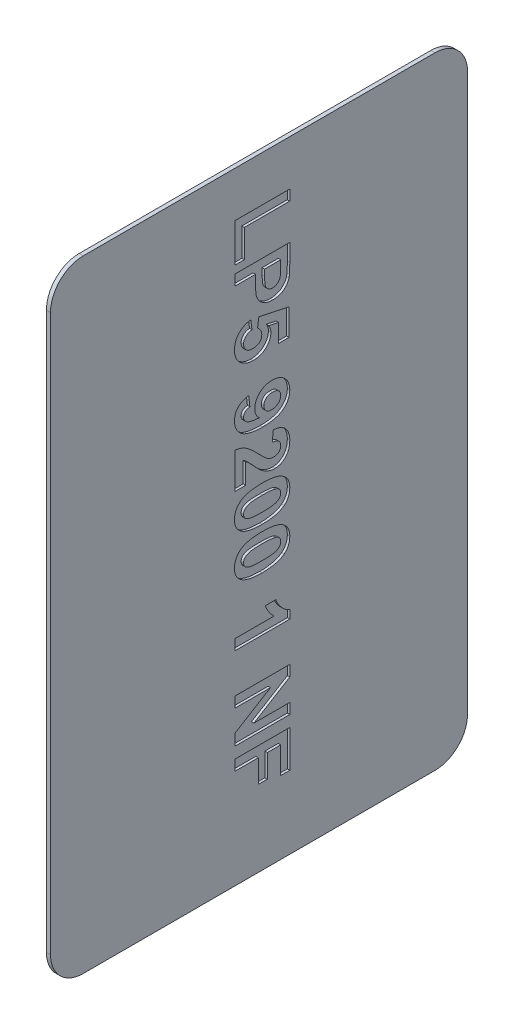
from build123d import *

# Parameters (mm, degrees)
BOSS_EXTRU_1_DEPTH      = 0.5
ENL_V_MAT_EXTRU_3_DEPTH = 0.3


with BuildPart() as part:
    # Esquisse1 → Boss.-Extru.1 (new body)
    with BuildSketch(Plane(origin=(0.5, 0, 0), x_dir=(0, 0, -1), z_dir=(1, 0, 0))):
        with BuildLine():
            Line((25.5, -34), (25.5, 34))
            ThreePointArc((25.5, 34), (24.328427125, 36.828427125), (21.5, 38))
            Line((21.5, 38), (-21.5, 38))
            ThreePointArc((-21.5, 38), (-24.328427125, 36.828427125), (-25.5, 34))
            Line((-25.5, 34), (-25.5, -34))
            ThreePointArc((-25.5, -34), (-24.328427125, -36.828427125), (-21.5, -38))
            Line((-21.5, -38), (21.5, -38))
            ThreePointArc((21.5, -38), (24.328427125, -36.828427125), (25.5, -34))
        make_face()
    extrude(amount=-BOSS_EXTRU_1_DEPTH)

    # Esquisse4 → Enl_v. mat.-Extru.3 (cut)
    # profile 1 of 10: a face of its own
    with BuildSketch(Plane(origin=(0.5, 0, 0), x_dir=(0, 0, -1), z_dir=(1, 0, 0))):
        Polygon((-2.919570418, 32.447935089), (3.758058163, 32.447935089), (3.758058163, 31.163775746), (-1.806632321, 31.163775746), (-1.806632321, 27.739350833), (-2.919570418, 27.739350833), align=None)
    # profile 2 of 10: a face of its own
    with BuildSketch(Plane(origin=(0.5, 0, 0), x_dir=(0, 0, -1), z_dir=(1, 0, 0))):
        with BuildLine():
            Line((-2.919570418, 26.797633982), (3.758058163, 26.797633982))
            Line((3.758058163, 26.797633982), (3.758058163, 24.661381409))
            add(Edge.make_bspline(
                [(3.758058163, 24.661381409), (3.757959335, 24.564620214), (3.757770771, 24.379998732), (3.752080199, 24.116014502), (3.74423189, 23.878329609), (3.734249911, 23.666868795), (3.719649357, 23.482189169), (3.702162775, 23.323880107), (3.684158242, 23.19121424), (3.664975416, 23.112701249), (3.656395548, 23.077584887)],
                knots=[0, 0, 0, 0, 1.460492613, 2.786636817, 3.985312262, 5.05006335, 5.98179196, 6.7807735, 7.454678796, 8, 8, 8, 8], degree=3))
            add(Edge.make_bspline(
                [(3.656395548, 23.077584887), (3.643079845, 23.030885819), (3.616651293, 22.938199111), (3.560309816, 22.805407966), (3.495013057, 22.677418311), (3.4171911, 22.555838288), (3.328225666, 22.440254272), (3.228841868, 22.330323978), (3.118592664, 22.225456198), (2.997689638, 22.12712091), (2.866766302, 22.036999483), (2.725538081, 21.95932971), (2.575098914, 21.893485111), (2.415008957, 21.840568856), (2.246316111, 21.796817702), (2.067513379, 21.768887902), (1.879991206, 21.748697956), (1.751617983, 21.747314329), (1.686013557, 21.746607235)],
                knots=[0, 0, 0, 0, 0.907183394, 1.800546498, 2.691728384, 3.591410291, 4.495216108, 5.416087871, 6.359626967, 7.337496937, 8.327236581, 9.327316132, 10.346534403, 11.393207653, 12.477041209, 13.600953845, 14.773980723, 16, 16, 16, 16], degree=3))
            add(Edge.make_bspline(
                [(1.686013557, 21.746607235), (1.586391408, 21.748667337), (1.3946133, 21.752633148), (1.119687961, 21.797035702), (0.868518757, 21.864699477), (0.643717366, 21.963801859), (0.443504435, 22.084086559), (0.265046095, 22.218759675), (0.108783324, 22.36889434), (-0.022888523, 22.533025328), (-0.131219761, 22.706185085), (-0.223460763, 22.879793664), (-0.294404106, 23.056024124), (-0.325311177, 23.176183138), (-0.340550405, 23.235429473)],
                knots=[0, 0, 0, 0, 1.312446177, 2.526530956, 3.662051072, 4.733637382, 5.754065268, 6.735959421, 7.675686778, 8.604015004, 9.502732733, 10.365317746, 11.193993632, 12, 12, 12, 12], degree=3))
            add(Edge.make_bspline(
                [(-0.340550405, 23.235429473), (-0.348594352, 23.277716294), (-0.365550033, 23.366851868), (-0.382451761, 23.508215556), (-0.401160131, 23.662733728), (-0.413362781, 23.831041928), (-0.424790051, 24.012936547), (-0.430185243, 24.208346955), (-0.436685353, 24.416993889), (-0.436802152, 24.560604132), (-0.436862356, 24.634628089)],
                knots=[0, 0, 0, 0, 0.735353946, 1.55003838, 2.431865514, 3.394945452, 4.432993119, 5.54609699, 6.735134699, 8, 8, 8, 8], degree=3))
            Line((-0.436862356, 24.634628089), (-0.436862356, 25.513474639))
            Line((-0.436862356, 25.513474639), (-2.919570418, 25.513474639))
            Line((-2.919570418, 25.513474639), (-2.919570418, 26.797633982))
        make_face()
        with BuildLine():
            Line((2.645120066, 25.513474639), (0.676075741, 25.513474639))
            Line((0.676075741, 25.513474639), (0.676075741, 24.742979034))
            add(Edge.make_bspline(
                [(0.676075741, 24.742979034), (0.676161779, 24.676535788), (0.676326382, 24.549421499), (0.682234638, 24.367040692), (0.68944676, 24.201949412), (0.701384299, 24.053802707), (0.717117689, 23.923494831), (0.735936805, 23.810153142), (0.756131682, 23.713645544), (0.789597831, 23.609285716), (0.843743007, 23.497704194), (0.921563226, 23.378548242), (1.014606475, 23.273869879), (1.12388255, 23.186763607), (1.2452946, 23.11718498), (1.377598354, 23.067366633), (1.518601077, 23.035198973), (1.616277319, 23.03226075), (1.665948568, 23.030766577)],
                knots=[0, 0, 0, 0, 1.411705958, 2.700771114, 3.876961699, 4.922619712, 5.858038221, 6.66485904, 7.363650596, 7.950905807, 8.989198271, 9.987739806, 10.967313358, 11.951275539, 12.944273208, 13.927870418, 14.946261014, 16, 16, 16, 16], degree=3))
            add(Edge.make_bspline(
                [(1.665948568, 23.030766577), (1.726447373, 23.032869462), (1.843746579, 23.036946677), (2.010800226, 23.081906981), (2.162403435, 23.151275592), (2.293839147, 23.250453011), (2.404365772, 23.370256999), (2.496327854, 23.504911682), (2.560683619, 23.657292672), (2.585619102, 23.765137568), (2.598301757, 23.819989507)],
                knots=[0, 0, 0, 0, 1.085904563, 2.105425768, 3.088705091, 4.068969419, 5.045188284, 6.010769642, 6.988240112, 8, 8, 8, 8], degree=3))
            add(Edge.make_bspline(
                [(2.598301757, 23.819989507), (2.602077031, 23.843593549), (2.610456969, 23.895987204), (2.619202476, 23.983076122), (2.627156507, 24.086102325), (2.633687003, 24.205190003), (2.638792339, 24.33986712), (2.643265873, 24.490577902), (2.643625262, 24.656925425), (2.644607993, 24.773300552), (2.645120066, 24.833940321)],
                knots=[0, 0, 0, 0, 0.564603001, 1.253243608, 2.066786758, 3.005752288, 4.070476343, 5.250658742, 6.567396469, 8, 8, 8, 8], degree=3))
            Line((2.645120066, 24.833940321), (2.645120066, 25.513474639))
        make_face(mode=Mode.SUBTRACT)
    # profile 3 of 10: a face of its own
    with BuildSketch(Plane(origin=(0.5, 0, 0), x_dir=(0, 0, -1), z_dir=(1, 0, 0))):
        with BuildLine():
            Line((-1.009383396, 20.976111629), (-0.86491547, 19.863173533))
            add(Edge.make_bspline(
                [(-0.86491547, 19.863173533), (-0.940370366, 19.850826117), (-1.085671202, 19.827049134), (-1.289073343, 19.753846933), (-1.466991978, 19.649489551), (-1.618022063, 19.518112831), (-1.739866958, 19.368247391), (-1.827938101, 19.203517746), (-1.882485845, 19.027429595), (-1.888975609, 18.90533951), (-1.892242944, 18.843872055)],
                knots=[0, 0, 0, 0, 1.155217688, 2.224562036, 3.249849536, 4.259092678, 5.238040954, 6.15568152, 7.071459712, 8, 8, 8, 8], degree=3))
            add(Edge.make_bspline(
                [(-1.892242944, 18.843872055), (-1.891615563, 18.808156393), (-1.890387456, 18.738242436), (-1.876443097, 18.635215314), (-1.853796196, 18.53679158), (-1.823033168, 18.442061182), (-1.78267174, 18.351933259), (-1.732734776, 18.266303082), (-1.674920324, 18.184116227), (-1.608736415, 18.106418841), (-1.531682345, 18.036686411), (-1.446452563, 17.974754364), (-1.351002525, 17.924086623), (-1.24799169, 17.880405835), (-1.134395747, 17.849504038), (-1.012987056, 17.824719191), (-0.882117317, 17.812127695), (-0.792256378, 17.809747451), (-0.745863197, 17.808518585)],
                knots=[0, 0, 0, 0, 0.98109136, 1.920501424, 2.850996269, 3.75396817, 4.653607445, 5.559568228, 6.474190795, 7.412641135, 8.358186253, 9.324081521, 10.300185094, 11.322066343, 12.392681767, 13.529496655, 14.72453472, 16, 16, 16, 16], degree=3))
            add(Edge.make_bspline(
                [(-0.745863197, 17.808518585), (-0.70213153, 17.809212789), (-0.617612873, 17.810554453), (-0.495159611, 17.82300196), (-0.380725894, 17.842108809), (-0.275148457, 17.872504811), (-0.176464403, 17.907219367), (-0.088172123, 17.954023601), (-0.006433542, 18.005378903), (0.064332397, 18.067976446), (0.126883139, 18.136170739), (0.182525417, 18.208838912), (0.229488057, 18.286950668), (0.268323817, 18.369766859), (0.298342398, 18.457645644), (0.317305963, 18.550778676), (0.331900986, 18.648120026), (0.333049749, 18.714951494), (0.33363325, 18.74889777)],
                knots=[0, 0, 0, 0, 1.292262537, 2.497510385, 3.635136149, 4.715991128, 5.741845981, 6.720379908, 7.663568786, 8.58853187, 9.502632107, 10.396263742, 11.289117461, 12.191261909, 13.095714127, 14.026387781, 14.997526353, 16, 16, 16, 16], degree=3))
            add(Edge.make_bspline(
                [(0.33363325, 18.74889777), (0.332094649, 18.791813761), (0.329025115, 18.877431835), (0.3040728, 19.003819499), (0.263450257, 19.126837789), (0.20690085, 19.246358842), (0.133972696, 19.362066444), (0.044423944, 19.47345964), (-0.060204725, 19.582450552), (-0.139259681, 19.649399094), (-0.180030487, 19.683926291)],
                knots=[0, 0, 0, 0, 0.931687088, 1.85873035, 2.786835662, 3.740075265, 4.723687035, 5.750832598, 6.840042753, 8, 8, 8, 8], degree=3))
            Line((-0.180030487, 19.683926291), (-0.022185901, 20.804890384))
            Line((-0.022185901, 20.804890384), (3.67244754, 20.034394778))
            Line((3.67244754, 20.034394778), (3.67244754, 16.781191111))
            Line((3.67244754, 16.781191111), (2.388288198, 16.781191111))
            Line((2.388288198, 16.781191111), (2.388288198, 19.004391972))
            Line((2.388288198, 19.004391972), (1.196427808, 19.266574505))
            add(Edge.make_bspline(
                [(1.196427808, 19.266574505), (1.234976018, 19.199762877), (1.310045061, 19.069653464), (1.387321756, 18.861932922), (1.436919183, 18.653145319), (1.443370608, 18.51240005), (1.446571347, 18.44257226)],
                knots=[0, 0, 0, 0, 1.060051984, 2.064352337, 3.039669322, 4, 4, 4, 4], degree=3))
            add(Edge.make_bspline(
                [(1.446571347, 18.44257226), (1.44480484, 18.376928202), (1.441315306, 18.247255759), (1.41268479, 18.057080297), (1.365498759, 17.874665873), (1.299834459, 17.699396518), (1.213765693, 17.532525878), (1.109738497, 17.37261542), (0.985947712, 17.221973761), (0.845967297, 17.078982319), (0.691095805, 16.948584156), (0.52221629, 16.83597497), (0.343534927, 16.738713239), (0.153077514, 16.65953066), (-0.049420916, 16.599903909), (-0.262216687, 16.555249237), (-0.486653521, 16.530234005), (-0.63968299, 16.526344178), (-0.717772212, 16.524359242)],
                knots=[0, 0, 0, 0, 0.974409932, 1.924837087, 2.848242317, 3.768103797, 4.697919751, 5.630842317, 6.595644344, 7.588240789, 8.59876155, 9.595918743, 10.597287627, 11.615415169, 12.652315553, 13.727511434, 14.840374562, 16, 16, 16, 16], degree=3))
            add(Edge.make_bspline(
                [(-0.717772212, 16.524359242), (-0.783364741, 16.526137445), (-0.913552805, 16.529666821), (-1.1061336, 16.550660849), (-1.293437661, 16.588790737), (-1.474938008, 16.640925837), (-1.652034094, 16.706659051), (-1.822837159, 16.788418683), (-1.988797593, 16.885197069), (-2.093456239, 16.960035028), (-2.14639948, 16.997893)],
                knots=[0, 0, 0, 0, 1.0275977, 2.039576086, 3.029943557, 4.018141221, 4.995043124, 5.985410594, 6.980887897, 8, 8, 8, 8], degree=3))
            add(Edge.make_bspline(
                [(-2.14639948, 16.997893), (-2.214583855, 17.053060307), (-2.348778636, 17.161635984), (-2.525114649, 17.347556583), (-2.673807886, 17.549876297), (-2.794289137, 17.768392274), (-2.890859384, 18.001289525), (-2.956813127, 18.251004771), (-2.997974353, 18.515664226), (-3.002743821, 18.697464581), (-3.005181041, 18.790365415)],
                knots=[0, 0, 0, 0, 1.018155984, 2.003849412, 2.967446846, 3.927472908, 4.896208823, 5.888955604, 6.921246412, 8, 8, 8, 8], degree=3))
            add(Edge.make_bspline(
                [(-3.005181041, 18.790365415), (-3.003821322, 18.865348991), (-3.001166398, 19.011758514), (-2.975087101, 19.226201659), (-2.932243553, 19.42972831), (-2.874175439, 19.623306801), (-2.796612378, 19.805098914), (-2.704597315, 19.977336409), (-2.594153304, 20.138705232), (-2.4667012, 20.28825619), (-2.325805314, 20.425576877), (-2.171646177, 20.548063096), (-2.006794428, 20.657043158), (-1.829586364, 20.75043873), (-1.641264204, 20.830033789), (-1.440862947, 20.893410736), (-1.229719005, 20.945592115), (-1.083641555, 20.965825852), (-1.009383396, 20.976111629)],
                knots=[0, 0, 0, 0, 1.098896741, 2.145655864, 3.16104256, 4.145315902, 5.10323158, 6.053780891, 7.003858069, 7.963890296, 8.930045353, 9.883557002, 10.846278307, 11.82296847, 12.816080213, 13.83936887, 14.901647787, 16, 16, 16, 16], degree=3))
        make_face()
    # profile 4 of 10: a face of its own
    with BuildSketch(Plane(origin=(0.5, 0, 0), x_dir=(0, 0, -1), z_dir=(1, 0, 0))):
        with BuildLine():
            Line((-1.263539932, 13.099934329), (-1.121747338, 11.815774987))
            add(Edge.make_bspline(
                [(-1.121747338, 11.815774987), (-1.18320919, 11.807323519), (-1.29938471, 11.791348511), (-1.459293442, 11.741002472), (-1.59553112, 11.675429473), (-1.705492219, 11.589161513), (-1.790434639, 11.486954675), (-1.850637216, 11.36871239), (-1.885672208, 11.23497789), (-1.889998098, 11.140911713), (-1.892242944, 11.092097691)],
                knots=[0, 0, 0, 0, 1.26161362, 2.384708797, 3.400080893, 4.324861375, 5.208596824, 6.085915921, 7.006719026, 8, 8, 8, 8], degree=3))
            add(Edge.make_bspline(
                [(-1.892242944, 11.092097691), (-1.891512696, 11.060321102), (-1.890069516, 10.997521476), (-1.869460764, 10.905710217), (-1.841159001, 10.817020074), (-1.797860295, 10.732687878), (-1.744994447, 10.651578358), (-1.679355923, 10.573910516), (-1.601470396, 10.501326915), (-1.51192282, 10.429313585), (-1.401964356, 10.364106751), (-1.268581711, 10.306565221), (-1.111828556, 10.252837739), (-0.929749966, 10.208704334), (-0.723916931, 10.168979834), (-0.493670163, 10.134421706), (-0.238869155, 10.106384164), (-0.060587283, 10.093991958), (0.032658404, 10.087510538)],
                knots=[0, 0, 0, 0, 0.636724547, 1.25834978, 1.881263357, 2.501920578, 3.155053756, 3.822273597, 4.537958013, 5.29028643, 6.125628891, 7.095655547, 8.202775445, 9.449278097, 10.854076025, 12.411617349, 14.123189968, 16, 16, 16, 16], degree=3))
            add(Edge.make_bspline(
                [(0.032658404, 10.087510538), (-0.011434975, 10.1285921), (-0.098371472, 10.209590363), (-0.212428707, 10.343742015), (-0.308321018, 10.486578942), (-0.385613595, 10.637370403), (-0.448761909, 10.794543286), (-0.490299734, 10.960681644), (-0.51879881, 11.133472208), (-0.521237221, 11.251606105), (-0.522472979, 11.311474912)],
                knots=[0, 0, 0, 0, 1.041520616, 2.053509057, 3.037255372, 4.009786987, 4.979165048, 5.959157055, 6.965725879, 8, 8, 8, 8], degree=3))
            add(Edge.make_bspline(
                [(-0.522472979, 11.311474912), (-0.520591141, 11.377105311), (-0.516875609, 11.506687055), (-0.489880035, 11.69731634), (-0.443875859, 11.881004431), (-0.379975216, 12.057967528), (-0.29583762, 12.227258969), (-0.195242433, 12.39032542), (-0.075099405, 12.545406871), (0.06035818, 12.693754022), (0.211370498, 12.828606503), (0.374234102, 12.948180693), (0.550055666, 13.046894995), (0.735309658, 13.130649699), (0.932673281, 13.193010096), (1.139817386, 13.238954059), (1.358481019, 13.265644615), (1.508032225, 13.269293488), (1.584350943, 13.271155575)],
                knots=[0, 0, 0, 0, 0.980383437, 1.935685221, 2.869563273, 3.805245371, 4.740737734, 5.689092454, 6.663095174, 7.667337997, 8.686386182, 9.683088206, 10.679589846, 11.693508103, 12.715274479, 13.765885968, 14.85989073, 16, 16, 16, 16], degree=3))
            add(Edge.make_bspline(
                [(1.584350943, 13.271155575), (1.663808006, 13.269449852), (1.819668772, 13.266103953), (2.046983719, 13.23720355), (2.26291773, 13.192053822), (2.467334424, 13.128306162), (2.659160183, 13.043202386), (2.839324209, 12.941127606), (3.008409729, 12.8216408), (3.161980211, 12.682269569), (3.302535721, 12.530705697), (3.424856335, 12.367221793), (3.527080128, 12.192745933), (3.612032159, 12.008829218), (3.677457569, 11.814090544), (3.724081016, 11.609774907), (3.752989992, 11.395683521), (3.756345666, 11.249589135), (3.758058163, 11.175032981)],
                knots=[0, 0, 0, 0, 1.123798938, 2.204412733, 3.236327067, 4.241910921, 5.227709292, 6.199561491, 7.167597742, 8.150444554, 9.128196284, 10.088368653, 11.032911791, 11.984193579, 12.949759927, 13.933760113, 14.945538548, 16, 16, 16, 16], degree=3))
            add(Edge.make_bspline(
                [(3.758058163, 11.175032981), (3.755818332, 11.093749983), (3.751426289, 10.934363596), (3.714669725, 10.700809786), (3.652701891, 10.47943187), (3.567956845, 10.26804138), (3.457679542, 10.068350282), (3.322616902, 9.879314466), (3.162364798, 9.703127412), (2.979368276, 9.536649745), (2.767952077, 9.385167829), (2.523599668, 9.256200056), (2.248636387, 9.146497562), (1.942468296, 9.057949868), (1.605174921, 8.988760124), (1.236762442, 8.941006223), (0.837157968, 8.909052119), (0.560212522, 8.906393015), (0.416568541, 8.90501381)],
                knots=[0, 0, 0, 0, 0.854865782, 1.676291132, 2.47987951, 3.269153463, 4.067024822, 4.87415214, 5.707903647, 6.56815891, 7.47290517, 8.436285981, 9.46773915, 10.58258962, 11.785118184, 13.086859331, 14.489034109, 16, 16, 16, 16], degree=3))
            add(Edge.make_bspline(
                [(0.416568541, 8.90501381), (0.270702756, 8.907008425), (-0.01111602, 8.910862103), (-0.417966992, 8.941921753), (-0.793602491, 8.991162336), (-1.137476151, 9.063300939), (-1.450246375, 9.154607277), (-1.732289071, 9.266634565), (-1.982848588, 9.400059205), (-2.201787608, 9.555346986), (-2.390591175, 9.727905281), (-2.555482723, 9.911632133), (-2.693933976, 10.108623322), (-2.809506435, 10.316854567), (-2.896032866, 10.539579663), (-2.958725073, 10.773679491), (-2.999334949, 11.019793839), (-3.003208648, 11.188247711), (-3.005181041, 11.274020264)],
                knots=[0, 0, 0, 0, 1.487370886, 2.873662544, 4.158543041, 5.348235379, 6.453208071, 7.477453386, 8.437714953, 9.341093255, 10.207028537, 11.041196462, 11.853665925, 12.657500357, 13.463902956, 14.28346725, 15.125983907, 16, 16, 16, 16], degree=3))
            add(Edge.make_bspline(
                [(-3.005181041, 11.274020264), (-3.003913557, 11.335603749), (-3.001426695, 11.456433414), (-2.981423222, 11.63333777), (-2.946654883, 11.801192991), (-2.898128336, 11.959462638), (-2.838354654, 12.109302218), (-2.76306753, 12.249403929), (-2.672257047, 12.379114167), (-2.570603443, 12.502111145), (-2.45418104, 12.614563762), (-2.322807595, 12.715038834), (-2.179387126, 12.806389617), (-2.022079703, 12.886707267), (-1.851227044, 12.955750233), (-1.66789352, 13.016510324), (-1.470345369, 13.064105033), (-1.33369249, 13.087780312), (-1.263539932, 13.099934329)],
                knots=[0, 0, 0, 0, 1.056859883, 2.073608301, 3.050756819, 3.994949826, 4.911632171, 5.815638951, 6.717894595, 7.625296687, 8.550849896, 9.48925579, 10.459546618, 11.465871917, 12.516171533, 13.619798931, 14.778092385, 16, 16, 16, 16], degree=3))
        make_face()
        with BuildLine():
            add(Edge.make_bspline(
                [(1.552246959, 10.189173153), (1.594673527, 10.189583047), (1.677129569, 10.190379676), (1.796207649, 10.206864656), (1.908747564, 10.226519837), (2.012978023, 10.259930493), (2.11185193, 10.298677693), (2.200918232, 10.351192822), (2.285774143, 10.407786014), (2.383055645, 10.498945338), (2.487487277, 10.622554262), (2.579121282, 10.787236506), (2.635922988, 10.964016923), (2.642027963, 11.08632962), (2.645120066, 11.148279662)],
                knots=[0, 0, 0, 0, 0.937216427, 1.821480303, 2.654971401, 3.459676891, 4.237908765, 4.997424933, 5.74142066, 6.488285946, 7.937648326, 9.301469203, 10.633223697, 12, 12, 12, 12], degree=3))
            add(Edge.make_bspline(
                [(2.645120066, 11.148279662), (2.64247747, 11.206098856), (2.637333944, 11.318637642), (2.591858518, 11.479490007), (2.51664954, 11.62459474), (2.430223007, 11.730622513), (2.347426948, 11.80650656), (2.272822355, 11.853624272), (2.190860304, 11.89600442), (2.098479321, 11.929008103), (1.997371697, 11.955578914), (1.886358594, 11.974257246), (1.766467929, 11.984464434), (1.683357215, 11.986135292), (1.640532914, 11.986996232)],
                knots=[0, 0, 0, 0, 1.397743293, 2.720555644, 4.009812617, 5.330023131, 6.010516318, 6.720186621, 7.458907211, 8.241080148, 9.089514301, 9.987599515, 10.963074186, 12, 12, 12, 12], degree=3))
            add(Edge.make_bspline(
                [(1.640532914, 11.986996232), (1.59680591, 11.986289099), (1.512296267, 11.984922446), (1.389780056, 11.972649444), (1.276530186, 11.953101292), (1.171771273, 11.925355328), (1.077014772, 11.886976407), (0.988935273, 11.844310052), (0.912485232, 11.789238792), (0.821719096, 11.709968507), (0.729352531, 11.593895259), (0.648802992, 11.436553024), (0.599008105, 11.262725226), (0.593358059, 11.141030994), (0.590465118, 11.078721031)],
                knots=[0, 0, 0, 0, 1.000044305, 1.932750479, 2.813125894, 3.627191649, 4.405654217, 5.149187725, 5.859445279, 6.553178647, 7.902402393, 9.220738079, 10.576960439, 12, 12, 12, 12], degree=3))
            add(Edge.make_bspline(
                [(0.590465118, 11.078721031), (0.592837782, 11.018167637), (0.597467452, 10.900012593), (0.646915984, 10.731910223), (0.722764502, 10.577591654), (0.812281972, 10.464690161), (0.897068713, 10.383980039), (0.969881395, 10.332033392), (1.049573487, 10.287251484), (1.136852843, 10.251488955), (1.23096147, 10.223362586), (1.331745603, 10.203557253), (1.439577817, 10.191257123), (1.513865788, 10.189883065), (1.552246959, 10.189173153)],
                knots=[0, 0, 0, 0, 1.470045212, 2.868431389, 4.227473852, 5.634383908, 6.348475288, 7.071419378, 7.805118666, 8.569021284, 9.362200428, 10.192314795, 11.06605236, 12, 12, 12, 12], degree=3))
        make_face(mode=Mode.SUBTRACT)
    # profile 5 of 10: a face of its own
    with BuildSketch(Plane(origin=(0.5, 0, 0), x_dir=(0, 0, -1), z_dir=(1, 0, 0))):
        with BuildLine():
            Line((-1.635411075, 3.768376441), (-2.919570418, 3.768376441))
            Line((-2.919570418, 3.768376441), (-2.919570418, 8.134518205))
            add(Edge.make_bspline(
                [(-2.919570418, 8.134518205), (-2.80983016, 8.119706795), (-2.590411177, 8.09009228), (-2.269561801, 7.999097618), (-1.957186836, 7.875396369), (-1.703229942, 7.742474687), (-1.496722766, 7.613222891), (-1.330680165, 7.491611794), (-1.150495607, 7.351183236), (-0.96038074, 7.187243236), (-0.756643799, 7.00388188), (-0.541080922, 6.798818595), (-0.314472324, 6.571406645), (-0.160604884, 6.411403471), (-0.081043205, 6.32866913)],
                knots=[0, 0, 0, 0, 1.156381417, 2.312114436, 3.475445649, 4.663832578, 5.302694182, 6.020660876, 6.814180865, 7.69035705, 8.644181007, 9.679458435, 10.800095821, 12, 12, 12, 12], degree=3))
            add(Edge.make_bspline(
                [(-0.081043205, 6.32866913), (-0.017325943, 6.262634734), (0.103972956, 6.136924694), (0.277853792, 5.958107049), (0.43684201, 5.80046708), (0.579926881, 5.663093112), (0.705496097, 5.544156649), (0.816457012, 5.446855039), (0.910731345, 5.36815392), (0.970582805, 5.325570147), (0.997115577, 5.30669232)],
                knots=[0, 0, 0, 0, 1.480739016, 2.818890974, 4.024686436, 5.093297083, 6.019761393, 6.815071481, 7.474708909, 8, 8, 8, 8], degree=3))
            add(Edge.make_bspline(
                [(0.997115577, 5.30669232), (1.06126676, 5.26783592), (1.184861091, 5.19297478), (1.380561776, 5.113784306), (1.57454218, 5.062099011), (1.704880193, 5.05568744), (1.768948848, 5.052535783)],
                knots=[0, 0, 0, 0, 1.091434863, 2.102769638, 3.067401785, 4, 4, 4, 4], degree=3))
            add(Edge.make_bspline(
                [(1.768948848, 5.052535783), (1.835594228, 5.054896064), (1.961682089, 5.059361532), (2.139128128, 5.098045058), (2.292751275, 5.163673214), (2.420738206, 5.257248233), (2.5218883, 5.375101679), (2.595444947, 5.513709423), (2.636956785, 5.673557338), (2.642318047, 5.785781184), (2.645120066, 5.844434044)],
                knots=[0, 0, 0, 0, 1.192552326, 2.256215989, 3.232470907, 4.163657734, 5.069678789, 5.991331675, 6.950186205, 8, 8, 8, 8], degree=3))
            add(Edge.make_bspline(
                [(2.645120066, 5.844434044), (2.642481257, 5.902677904), (2.637383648, 6.015192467), (2.592851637, 6.175100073), (2.51576204, 6.314989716), (2.427911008, 6.414682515), (2.342482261, 6.48202973), (2.268036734, 6.527917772), (2.183443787, 6.567469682), (2.089655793, 6.602515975), (1.985598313, 6.630198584), (1.872063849, 6.652492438), (1.748441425, 6.670458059), (1.662440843, 6.676171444), (1.617792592, 6.679137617)],
                knots=[0, 0, 0, 0, 1.402788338, 2.709884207, 3.961032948, 5.225417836, 5.883680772, 6.578928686, 7.329201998, 8.132101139, 8.990263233, 9.922304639, 10.921339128, 12, 12, 12, 12], degree=3))
            Line((1.617792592, 6.679137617), (1.743533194, 7.963296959))
            add(Edge.make_bspline(
                [(1.743533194, 7.963296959), (1.830230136, 7.952972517), (1.998321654, 7.932955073), (2.23975903, 7.883001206), (2.462495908, 7.819736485), (2.666118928, 7.740144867), (2.851922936, 7.64751597), (3.017119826, 7.53712495), (3.163539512, 7.412828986), (3.291104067, 7.274520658), (3.400219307, 7.123079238), (3.497621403, 6.96416864), (3.577522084, 6.794683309), (3.64337225, 6.616489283), (3.695999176, 6.42966709), (3.730795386, 6.233352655), (3.755271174, 6.028757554), (3.757115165, 5.889100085), (3.758058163, 5.817680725)],
                knots=[0, 0, 0, 0, 1.270971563, 2.464210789, 3.586263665, 4.638946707, 5.643716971, 6.603612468, 7.52484387, 8.434700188, 9.336036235, 10.239171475, 11.145359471, 12.059630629, 13.003312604, 13.96741569, 14.960557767, 16, 16, 16, 16], degree=3))
            add(Edge.make_bspline(
                [(3.758058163, 5.817680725), (3.756566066, 5.740038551), (3.753660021, 5.588820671), (3.729657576, 5.368071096), (3.687816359, 5.160686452), (3.632357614, 4.964882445), (3.558437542, 4.782568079), (3.468474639, 4.612264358), (3.361042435, 4.455701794), (3.239126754, 4.312711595), (3.106447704, 4.184372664), (2.962686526, 4.07449707), (2.813475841, 3.978033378), (2.65379211, 3.902309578), (2.487640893, 3.84061506), (2.312090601, 3.800918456), (2.129741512, 3.771890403), (2.004946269, 3.769560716), (1.94150776, 3.768376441)],
                knots=[0, 0, 0, 0, 1.21054264, 2.357683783, 3.456743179, 4.506371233, 5.526380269, 6.518616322, 7.504105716, 8.480749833, 9.444588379, 10.376395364, 11.298423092, 12.209585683, 13.126776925, 14.056012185, 15.011791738, 16, 16, 16, 16], degree=3))
            add(Edge.make_bspline(
                [(1.94150776, 3.768376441), (1.868719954, 3.77001321), (1.724320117, 3.773260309), (1.510829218, 3.804247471), (1.302359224, 3.851823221), (1.09776064, 3.921322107), (0.894338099, 4.012620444), (0.687076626, 4.124387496), (0.476152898, 4.259763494), (0.337921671, 4.362770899), (0.266749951, 4.415806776)],
                knots=[0, 0, 0, 0, 0.953498, 1.891593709, 2.82157134, 3.753035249, 4.718494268, 5.740911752, 6.836853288, 8, 8, 8, 8], degree=3))
            add(Edge.make_bspline(
                [(0.266749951, 4.415806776), (0.241150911, 4.436098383), (0.1863237, 4.479558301), (0.102868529, 4.553717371), (0.009600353, 4.637885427), (-0.089548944, 4.735921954), (-0.198863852, 4.844226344), (-0.314220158, 4.965668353), (-0.437666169, 5.099021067), (-0.566699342, 5.238925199), (-0.691856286, 5.380230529), (-0.811092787, 5.509417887), (-0.918284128, 5.625159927), (-1.014662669, 5.726339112), (-1.098371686, 5.814732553), (-1.171149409, 5.88865404), (-1.231902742, 5.949294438), (-1.32657785, 6.032873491), (-1.45463348, 6.139211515), (-1.576991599, 6.214026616), (-1.635411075, 6.249746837)],
                knots=[0, 0, 0, 0, 0.665546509, 1.425446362, 2.274432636, 3.225431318, 4.2662943, 5.410247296, 6.638261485, 7.969509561, 9.288545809, 10.484715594, 11.551975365, 12.503234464, 13.332293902, 14.032657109, 14.617374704, 15.080693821, 16.606187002, 18, 18, 18, 18], degree=3))
            Line((-1.635411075, 6.249746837), (-1.635411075, 3.768376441))
        make_face()
    # profile 6 of 10: a face of its own
    with BuildSketch(Plane(origin=(0.5, 0, 0), x_dir=(0, 0, -1), z_dir=(1, 0, 0))):
        with BuildLine():
            add(Edge.make_bspline(
                [(3.758058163, 0.814809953), (3.756147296, 0.735321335), (3.752427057, 0.580566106), (3.719277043, 0.355113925), (3.666676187, 0.143081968), (3.590694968, -0.055570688), (3.494530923, -0.24185433), (3.373912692, -0.413147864), (3.234696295, -0.573417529), (3.126592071, -0.665940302), (3.071835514, -0.712804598)],
                knots=[0, 0, 0, 0, 1.098626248, 2.138899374, 3.143835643, 4.113754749, 5.073488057, 6.034745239, 7.004566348, 8, 8, 8, 8], degree=3))
            add(Edge.make_bspline(
                [(3.071835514, -0.712804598), (3.036966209, -0.73961327), (2.965804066, -0.79432507), (2.850813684, -0.86800873), (2.728835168, -0.938849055), (2.596927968, -1.00067216), (2.45739872, -1.059925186), (2.309859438, -1.114620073), (2.153476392, -1.162915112), (1.988961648, -1.205016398), (1.816065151, -1.244370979), (1.63436526, -1.277339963), (1.44432156, -1.305555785), (1.246141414, -1.327560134), (1.040213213, -1.347288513), (0.82552966, -1.358083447), (0.602577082, -1.366927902), (0.45091205, -1.367811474), (0.373763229, -1.368260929)],
                knots=[0, 0, 0, 0, 0.746775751, 1.524038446, 2.317840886, 3.141016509, 3.996283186, 4.892488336, 5.812382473, 6.774967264, 7.776368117, 8.823659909, 9.910833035, 11.039122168, 12.210293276, 13.424012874, 14.68964937, 16, 16, 16, 16], degree=3))
            add(Edge.make_bspline(
                [(0.373763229, -1.368260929), (0.29661423, -1.367818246), (0.145394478, -1.366950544), (-0.077110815, -1.358050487), (-0.291346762, -1.347278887), (-0.497285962, -1.327606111), (-0.695426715, -1.305390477), (-0.885257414, -1.277975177), (-1.06612242, -1.242460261), (-1.238743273, -1.203685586), (-1.403956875, -1.16185252), (-1.560057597, -1.111410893), (-1.709435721, -1.058922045), (-1.849144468, -0.998291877), (-1.981214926, -0.934250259), (-2.104438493, -0.864464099), (-2.220141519, -0.789957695), (-2.291679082, -0.734716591), (-2.326984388, -0.707453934)],
                knots=[0, 0, 0, 0, 1.308411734, 2.564617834, 3.776541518, 4.94597967, 6.0725993, 7.15816376, 8.197872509, 9.197791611, 10.158952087, 11.086962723, 11.979249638, 12.843171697, 13.668427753, 14.467630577, 15.243743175, 16, 16, 16, 16], degree=3))
            add(Edge.make_bspline(
                [(-2.326984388, -0.707453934), (-2.381271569, -0.661018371), (-2.488437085, -0.569352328), (-2.626499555, -0.410857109), (-2.74462693, -0.239840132), (-2.838865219, -0.053893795), (-2.915356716, 0.143791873), (-2.966270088, 0.35616924), (-2.999487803, 0.581005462), (-3.003256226, 0.735763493), (-3.005181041, 0.814809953)],
                knots=[0, 0, 0, 0, 0.991667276, 1.957599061, 2.911530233, 3.873218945, 4.847995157, 5.850445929, 6.902062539, 8, 8, 8, 8], degree=3))
            add(Edge.make_bspline(
                [(-3.005181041, 0.814809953), (-3.002880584, 0.894757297), (-2.998372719, 1.051418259), (-2.962637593, 1.280150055), (-2.905390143, 1.497570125), (-2.823656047, 1.702897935), (-2.717734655, 1.895839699), (-2.590764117, 2.077902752), (-2.436995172, 2.245126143), (-2.293844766, 2.37604381), (-2.164497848, 2.471823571), (-2.057238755, 2.539376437), (-1.942467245, 2.604659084), (-1.816594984, 2.661005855), (-1.683344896, 2.716596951), (-1.539845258, 2.765833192), (-1.387330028, 2.809272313), (-1.226495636, 2.850058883), (-1.056234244, 2.884068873), (-0.877048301, 2.915353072), (-0.688175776, 2.940006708), (-0.490668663, 2.961864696), (-0.284060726, 2.977253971), (-0.068690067, 2.989752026), (0.156132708, 2.996018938), (0.309106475, 2.997251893), (0.387139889, 2.997880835)],
                knots=[0, 0, 0, 0, 1.257818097, 2.464759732, 3.634271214, 4.790227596, 5.933394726, 7.09190477, 8.274482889, 9.50191983, 10.139172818, 10.805000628, 11.49619854, 12.215266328, 12.973768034, 13.768328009, 14.601232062, 15.469317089, 16.379095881, 17.333267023, 18.331755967, 19.376479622, 20.460535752, 21.592206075, 22.771760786, 24, 24, 24, 24], degree=3))
            add(Edge.make_bspline(
                [(0.387139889, 2.997880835), (0.463843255, 2.997441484), (0.614171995, 2.996580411), (0.83578187, 2.987618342), (1.049135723, 2.976978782), (1.254613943, 2.957128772), (1.451878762, 2.935095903), (1.641277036, 2.907633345), (1.82142922, 2.871453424), (1.994337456, 2.835734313), (2.158308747, 2.790727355), (2.314292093, 2.741143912), (2.463336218, 2.688829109), (2.602322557, 2.627580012), (2.734109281, 2.563909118), (2.857311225, 2.49407408), (2.973019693, 2.419579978), (3.044556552, 2.364337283), (3.07986151, 2.33707384)],
                knots=[0, 0, 0, 0, 1.304443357, 2.556541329, 3.771813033, 4.936929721, 6.066661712, 7.147723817, 8.190304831, 9.191350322, 10.149780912, 11.080355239, 11.975107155, 12.834450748, 13.66198663, 14.463397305, 15.241653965, 16, 16, 16, 16], degree=3))
            add(Edge.make_bspline(
                [(3.07986151, 2.33707384), (3.13414347, 2.290635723), (3.241298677, 2.198964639), (3.379436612, 2.040506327), (3.497056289, 1.869678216), (3.592436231, 1.684274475), (3.667893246, 1.486134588), (3.719216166, 1.27347892), (3.752346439, 1.048606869), (3.756127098, 0.893853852), (3.758058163, 0.814809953)],
                knots=[0, 0, 0, 0, 0.991631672, 1.957528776, 2.911425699, 3.867574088, 4.848108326, 5.850523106, 6.902101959, 8, 8, 8, 8], degree=3))
        make_face()
        with BuildLine():
            add(Edge.make_bspline(
                [(2.645120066, 0.814809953), (2.643348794, 0.85599734), (2.639882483, 0.936599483), (2.611617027, 1.053824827), (2.567835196, 1.164547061), (2.503536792, 1.268437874), (2.416476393, 1.364652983), (2.298836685, 1.446172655), (2.154636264, 1.516645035), (2.046822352, 1.551900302), (1.989663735, 1.570591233)],
                knots=[0, 0, 0, 0, 0.909107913, 1.77908945, 2.650019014, 3.530482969, 4.465025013, 5.495890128, 6.672421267, 8, 8, 8, 8], degree=3))
            add(Edge.make_bspline(
                [(1.989663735, 1.570591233), (1.946538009, 1.582264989), (1.85384941, 1.607354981), (1.702728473, 1.635831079), (1.531222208, 1.65931473), (1.339370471, 1.679144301), (1.12707174, 1.695281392), (0.894190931, 1.705219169), (0.640891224, 1.71208798), (0.465175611, 1.713162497), (0.373763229, 1.713721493)],
                knots=[0, 0, 0, 0, 0.658986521, 1.416336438, 2.266694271, 3.212608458, 4.261595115, 5.407496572, 6.651304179, 8, 8, 8, 8], degree=3))
            add(Edge.make_bspline(
                [(0.373763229, 1.713721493), (0.28279359, 1.713781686), (0.108406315, 1.713897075), (-0.141720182, 1.706055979), (-0.369744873, 1.698260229), (-0.575663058, 1.682436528), (-0.76020058, 1.666823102), (-0.921941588, 1.643200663), (-1.062240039, 1.61947682), (-1.213348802, 1.579187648), (-1.372081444, 1.5236581), (-1.533621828, 1.448678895), (-1.661087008, 1.364100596), (-1.753761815, 1.267064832), (-1.815073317, 1.161923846), (-1.861421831, 1.053052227), (-1.886185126, 0.935847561), (-1.890207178, 0.85548536), (-1.892242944, 0.814809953)],
                knots=[0, 0, 0, 0, 1.613038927, 3.092168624, 4.43749063, 5.658264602, 6.75425577, 7.720394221, 8.556328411, 9.275513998, 10.490872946, 11.534172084, 12.42681833, 13.187531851, 13.88996177, 14.574222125, 15.278341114, 16, 16, 16, 16], degree=3))
            add(Edge.make_bspline(
                [(-1.892242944, 0.814809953), (-1.890377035, 0.774090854), (-1.886686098, 0.693544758), (-1.859332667, 0.576472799), (-1.814193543, 0.46590799), (-1.751179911, 0.361317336), (-1.66351928, 0.265012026), (-1.545985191, 0.1834328), (-1.401751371, 0.112979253), (-1.293942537, 0.077721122), (-1.236786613, 0.059028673)],
                knots=[0, 0, 0, 0, 0.899391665, 1.779078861, 2.640979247, 3.529945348, 4.464599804, 5.495588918, 6.672261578, 8, 8, 8, 8], degree=3))
            add(Edge.make_bspline(
                [(-1.236786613, 0.059028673), (-1.193657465, 0.047371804), (-1.101384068, 0.022432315), (-0.951203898, -0.006246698), (-0.78058637, -0.029793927), (-0.589607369, -0.049434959), (-0.377767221, -0.065730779), (-0.145325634, -0.075584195), (0.107526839, -0.082459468), (0.282796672, -0.083540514), (0.373763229, -0.084101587)],
                knots=[0, 0, 0, 0, 0.66114423, 1.414496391, 2.261103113, 3.210114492, 4.255954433, 5.405607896, 6.653488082, 8, 8, 8, 8], degree=3))
            add(Edge.make_bspline(
                [(0.373763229, -0.084101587), (0.46472347, -0.083341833), (0.639078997, -0.081885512), (0.889776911, -0.077699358), (1.118025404, -0.065980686), (1.324290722, -0.054253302), (1.507889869, -0.034451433), (1.669816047, -0.014799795), (1.809383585, 0.012392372), (1.961550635, 0.049733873), (2.121030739, 0.105411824), (2.281723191, 0.182686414), (2.410455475, 0.265736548), (2.503640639, 0.362608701), (2.567327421, 0.467568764), (2.611939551, 0.577431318), (2.639715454, 0.693950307), (2.643298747, 0.774081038), (2.645120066, 0.814809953)],
                knots=[0, 0, 0, 0, 1.611458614, 3.088895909, 4.441089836, 5.660086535, 6.747875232, 7.711965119, 8.548505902, 9.26500436, 10.486583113, 11.532259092, 12.419544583, 13.184925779, 13.890764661, 14.581638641, 15.279074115, 16, 16, 16, 16], degree=3))
        make_face(mode=Mode.SUBTRACT)
    # profile 7 of 10: a face of its own
    with BuildSketch(Plane(origin=(0.5, 0, 0), x_dir=(0, 0, -1), z_dir=(1, 0, 0))):
        with BuildLine():
            add(Edge.make_bspline(
                [(3.758058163, -4.321827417), (3.756147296, -4.401316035), (3.752427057, -4.556071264), (3.719277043, -4.781523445), (3.666676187, -4.993555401), (3.590694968, -5.192208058), (3.494530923, -5.3784917), (3.373912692, -5.549785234), (3.234696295, -5.710054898), (3.126592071, -5.802577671), (3.071835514, -5.849441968)],
                knots=[0, 0, 0, 0, 1.098626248, 2.138899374, 3.143835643, 4.113754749, 5.073488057, 6.034745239, 7.004566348, 8, 8, 8, 8], degree=3))
            add(Edge.make_bspline(
                [(3.071835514, -5.849441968), (3.036966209, -5.876250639), (2.965804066, -5.93096244), (2.850813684, -6.0046461), (2.728835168, -6.075486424), (2.596927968, -6.137309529), (2.45739872, -6.196562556), (2.309859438, -6.251257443), (2.153476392, -6.299552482), (1.988961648, -6.341653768), (1.816065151, -6.381008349), (1.63436526, -6.413977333), (1.44432156, -6.442193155), (1.246141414, -6.464197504), (1.040213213, -6.483925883), (0.82552966, -6.494720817), (0.602577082, -6.503565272), (0.45091205, -6.504448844), (0.373763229, -6.504898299)],
                knots=[0, 0, 0, 0, 0.746775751, 1.524038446, 2.317840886, 3.141016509, 3.996283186, 4.892488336, 5.812382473, 6.774967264, 7.776368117, 8.823659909, 9.910833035, 11.039122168, 12.210293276, 13.424012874, 14.68964937, 16, 16, 16, 16], degree=3))
            add(Edge.make_bspline(
                [(0.373763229, -6.504898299), (0.29661423, -6.504455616), (0.145394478, -6.503587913), (-0.077110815, -6.494687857), (-0.291346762, -6.483916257), (-0.497285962, -6.464243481), (-0.695426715, -6.442027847), (-0.885257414, -6.414612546), (-1.06612242, -6.379097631), (-1.238743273, -6.340322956), (-1.403956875, -6.29848989), (-1.560057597, -6.248048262), (-1.709435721, -6.195559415), (-1.849144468, -6.134929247), (-1.981214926, -6.070887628), (-2.104438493, -6.001101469), (-2.220141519, -5.926595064), (-2.291679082, -5.871353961), (-2.326984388, -5.844091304)],
                knots=[0, 0, 0, 0, 1.308411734, 2.564617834, 3.776541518, 4.94597967, 6.0725993, 7.15816376, 8.197872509, 9.197791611, 10.158952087, 11.086962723, 11.979249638, 12.843171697, 13.668427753, 14.467630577, 15.243743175, 16, 16, 16, 16], degree=3))
            add(Edge.make_bspline(
                [(-2.326984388, -5.844091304), (-2.381271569, -5.797655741), (-2.488437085, -5.705989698), (-2.626499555, -5.547494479), (-2.74462693, -5.376477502), (-2.838865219, -5.190531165), (-2.915356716, -4.992845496), (-2.966270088, -4.780468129), (-2.999487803, -4.555631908), (-3.003256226, -4.400873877), (-3.005181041, -4.321827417)],
                knots=[0, 0, 0, 0, 0.991667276, 1.957599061, 2.911530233, 3.873218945, 4.847995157, 5.850445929, 6.902062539, 8, 8, 8, 8], degree=3))
            add(Edge.make_bspline(
                [(-3.005181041, -4.321827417), (-3.002880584, -4.241880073), (-2.998372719, -4.085219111), (-2.962637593, -3.856487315), (-2.905390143, -3.639067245), (-2.823656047, -3.433739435), (-2.717734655, -3.240797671), (-2.590764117, -3.058734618), (-2.436995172, -2.891511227), (-2.293844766, -2.76059356), (-2.164497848, -2.664813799), (-2.057238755, -2.597260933), (-1.942467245, -2.531978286), (-1.816594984, -2.475631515), (-1.683344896, -2.420040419), (-1.539845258, -2.370804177), (-1.387330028, -2.327365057), (-1.226495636, -2.286578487), (-1.056234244, -2.252568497), (-0.877048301, -2.221284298), (-0.688175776, -2.196630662), (-0.490668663, -2.174772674), (-0.284060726, -2.159383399), (-0.068690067, -2.146885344), (0.156132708, -2.140618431), (0.309106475, -2.139385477), (0.387139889, -2.138756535)],
                knots=[0, 0, 0, 0, 1.257818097, 2.464759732, 3.634271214, 4.790227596, 5.933394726, 7.09190477, 8.274482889, 9.50191983, 10.139172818, 10.805000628, 11.49619854, 12.215266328, 12.973768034, 13.768328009, 14.601232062, 15.469317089, 16.379095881, 17.333267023, 18.331755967, 19.376479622, 20.460535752, 21.592206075, 22.771760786, 24, 24, 24, 24], degree=3))
            add(Edge.make_bspline(
                [(0.387139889, -2.138756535), (0.463843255, -2.139195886), (0.614171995, -2.140056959), (0.83578187, -2.149019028), (1.049135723, -2.159658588), (1.254613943, -2.179508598), (1.451878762, -2.201541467), (1.641277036, -2.229004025), (1.82142922, -2.265183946), (1.994337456, -2.300903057), (2.158308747, -2.345910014), (2.314292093, -2.395493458), (2.463336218, -2.447808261), (2.602322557, -2.509057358), (2.734109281, -2.572728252), (2.857311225, -2.64256329), (2.973019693, -2.717057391), (3.044556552, -2.772300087), (3.07986151, -2.79956353)],
                knots=[0, 0, 0, 0, 1.304443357, 2.556541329, 3.771813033, 4.936929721, 6.066661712, 7.147723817, 8.190304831, 9.191350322, 10.149780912, 11.080355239, 11.975107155, 12.834450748, 13.66198663, 14.463397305, 15.241653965, 16, 16, 16, 16], degree=3))
            add(Edge.make_bspline(
                [(3.07986151, -2.79956353), (3.13414347, -2.846001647), (3.241298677, -2.937672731), (3.379436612, -3.096131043), (3.497056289, -3.266959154), (3.592436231, -3.452362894), (3.667893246, -3.650502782), (3.719216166, -3.863158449), (3.752346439, -4.088030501), (3.756127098, -4.242783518), (3.758058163, -4.321827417)],
                knots=[0, 0, 0, 0, 0.991631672, 1.957528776, 2.911425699, 3.867574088, 4.848108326, 5.850523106, 6.902101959, 8, 8, 8, 8], degree=3))
        make_face()
        with BuildLine():
            add(Edge.make_bspline(
                [(2.645120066, -4.321827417), (2.643348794, -4.28064003), (2.639882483, -4.200037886), (2.611617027, -4.082812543), (2.567835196, -3.972090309), (2.503536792, -3.868199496), (2.416476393, -3.771984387), (2.298836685, -3.690464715), (2.154636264, -3.619992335), (2.046822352, -3.584737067), (1.989663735, -3.566046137)],
                knots=[0, 0, 0, 0, 0.909107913, 1.77908945, 2.650019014, 3.530482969, 4.465025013, 5.495890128, 6.672421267, 8, 8, 8, 8], degree=3))
            add(Edge.make_bspline(
                [(1.989663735, -3.566046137), (1.946538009, -3.554372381), (1.85384941, -3.529282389), (1.702728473, -3.500806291), (1.531222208, -3.47732264), (1.339370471, -3.457493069), (1.12707174, -3.441355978), (0.894190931, -3.431418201), (0.640891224, -3.42454939), (0.465175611, -3.423474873), (0.373763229, -3.422915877)],
                knots=[0, 0, 0, 0, 0.658986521, 1.416336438, 2.266694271, 3.212608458, 4.261595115, 5.407496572, 6.651304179, 8, 8, 8, 8], degree=3))
            add(Edge.make_bspline(
                [(0.373763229, -3.422915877), (0.28279359, -3.422855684), (0.108406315, -3.422740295), (-0.141720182, -3.430581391), (-0.369744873, -3.438377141), (-0.575663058, -3.454200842), (-0.76020058, -3.469814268), (-0.921941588, -3.493436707), (-1.062240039, -3.517160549), (-1.213348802, -3.557449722), (-1.372081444, -3.61297927), (-1.533621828, -3.687958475), (-1.661087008, -3.772536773), (-1.753761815, -3.869572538), (-1.815073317, -3.974713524), (-1.861421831, -4.083585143), (-1.886185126, -4.200789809), (-1.890207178, -4.281152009), (-1.892242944, -4.321827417)],
                knots=[0, 0, 0, 0, 1.613038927, 3.092168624, 4.43749063, 5.658264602, 6.75425577, 7.720394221, 8.556328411, 9.275513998, 10.490872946, 11.534172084, 12.42681833, 13.187531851, 13.88996177, 14.574222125, 15.278341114, 16, 16, 16, 16], degree=3))
            add(Edge.make_bspline(
                [(-1.892242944, -4.321827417), (-1.890377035, -4.362546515), (-1.886686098, -4.443092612), (-1.859332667, -4.560164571), (-1.814193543, -4.67072938), (-1.751179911, -4.775320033), (-1.66351928, -4.871625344), (-1.545985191, -4.95320457), (-1.401751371, -5.023658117), (-1.293942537, -5.058916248), (-1.236786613, -5.077608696)],
                knots=[0, 0, 0, 0, 0.899391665, 1.779078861, 2.640979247, 3.529945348, 4.464599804, 5.495588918, 6.672261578, 8, 8, 8, 8], degree=3))
            add(Edge.make_bspline(
                [(-1.236786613, -5.077608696), (-1.193657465, -5.089265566), (-1.101384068, -5.114205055), (-0.951203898, -5.142884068), (-0.78058637, -5.166431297), (-0.589607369, -5.186072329), (-0.377767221, -5.202368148), (-0.145325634, -5.212221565), (0.107526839, -5.219096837), (0.282796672, -5.220177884), (0.373763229, -5.220738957)],
                knots=[0, 0, 0, 0, 0.66114423, 1.414496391, 2.261103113, 3.210114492, 4.255954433, 5.405607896, 6.653488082, 8, 8, 8, 8], degree=3))
            add(Edge.make_bspline(
                [(0.373763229, -5.220738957), (0.46472347, -5.219979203), (0.639078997, -5.218522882), (0.889776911, -5.214336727), (1.118025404, -5.202618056), (1.324290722, -5.190890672), (1.507889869, -5.171088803), (1.669816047, -5.151437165), (1.809383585, -5.124244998), (1.961550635, -5.086903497), (2.121030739, -5.031225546), (2.281723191, -4.953950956), (2.410455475, -4.870900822), (2.503640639, -4.774028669), (2.567327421, -4.669068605), (2.611939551, -4.559206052), (2.639715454, -4.442687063), (2.643298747, -4.362556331), (2.645120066, -4.321827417)],
                knots=[0, 0, 0, 0, 1.611458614, 3.088895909, 4.441089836, 5.660086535, 6.747875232, 7.711965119, 8.548505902, 9.26500436, 10.486583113, 11.532259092, 12.419544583, 13.184925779, 13.890764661, 14.581638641, 15.279074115, 16, 16, 16, 16], degree=3))
        make_face(mode=Mode.SUBTRACT)
    # profile 8 of 10: a face of its own
    with BuildSketch(Plane(origin=(0.5, 0, 0), x_dir=(0, 0, -1), z_dir=(1, 0, 0))):
        with BuildLine():
            Line((-2.919570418, -13.096916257), (-2.919570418, -11.812756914))
            Line((-2.919570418, -11.812756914), (1.834494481, -11.812756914))
            add(Edge.make_bspline(
                [(1.834494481, -11.812756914), (1.775310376, -11.754634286), (1.657507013, -11.638943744), (1.495224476, -11.453050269), (1.341476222, -11.262528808), (1.20270308, -11.061805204), (1.073516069, -10.854749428), (0.958073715, -10.638695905), (0.850536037, -10.416991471), (0.791382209, -10.263306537), (0.761686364, -10.186155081)],
                knots=[0, 0, 0, 0, 1.012608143, 2.015552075, 3.011331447, 4.000718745, 4.993456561, 5.989905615, 6.990911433, 8, 8, 8, 8], degree=3))
            Line((0.761686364, -10.186155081), (2.045845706, -10.186155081))
            add(Edge.make_bspline(
                [(2.045845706, -10.186155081), (2.077900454, -10.271683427), (2.144988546, -10.450687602), (2.288129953, -10.715023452), (2.464206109, -10.991544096), (2.637190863, -11.223552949), (2.792421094, -11.406026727), (2.915816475, -11.534516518), (3.042747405, -11.653537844), (3.176670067, -11.758715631), (3.314980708, -11.852721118), (3.457426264, -11.936018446), (3.604463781, -12.009338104), (3.706857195, -12.047720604), (3.758058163, -12.066913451)],
                knots=[0, 0, 0, 0, 1.253621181, 2.623731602, 4.119264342, 5.756158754, 6.594718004, 7.409281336, 8.202581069, 8.983291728, 9.746205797, 10.498494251, 11.24918464, 12, 12, 12, 12], degree=3))
            Line((3.758058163, -12.066913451), (3.758058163, -13.096916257))
            Line((3.758058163, -13.096916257), (-2.919570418, -13.096916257))
        make_face()
    # profile 9 of 10: a face of its own
    with BuildSketch(Plane(origin=(0.5, 0, 0), x_dir=(0, 0, -1), z_dir=(1, 0, 0))):
        Polygon((-2.919570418, -17.891111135), (3.758058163, -17.891111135), (3.758058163, -19.232790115), (-0.629486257, -21.914810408), (3.758058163, -21.914810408), (3.758058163, -23.198969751), (-2.919570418, -23.198969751), (-2.919570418, -21.817160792), (1.401090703, -19.175270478), (-2.919570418, -19.175270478), align=None)
    # profile 10 of 10: a face of its own
    with BuildSketch(Plane(origin=(0.5, 0, 0), x_dir=(0, 0, -1), z_dir=(1, 0, 0))):
        Polygon((-2.919570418, -24.568739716), (3.758058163, -24.568739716), (3.758058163, -29.106102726), (2.645120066, -29.106102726), (2.645120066, -25.852899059), (1.018518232, -25.852899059), (1.018518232, -28.678049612), (-0.094419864, -28.678049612), (-0.094419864, -25.852899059), (-2.919570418, -25.852899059), align=None)
    extrude(amount=-ENL_V_MAT_EXTRU_3_DEPTH, mode=Mode.SUBTRACT)


solid = part.part
